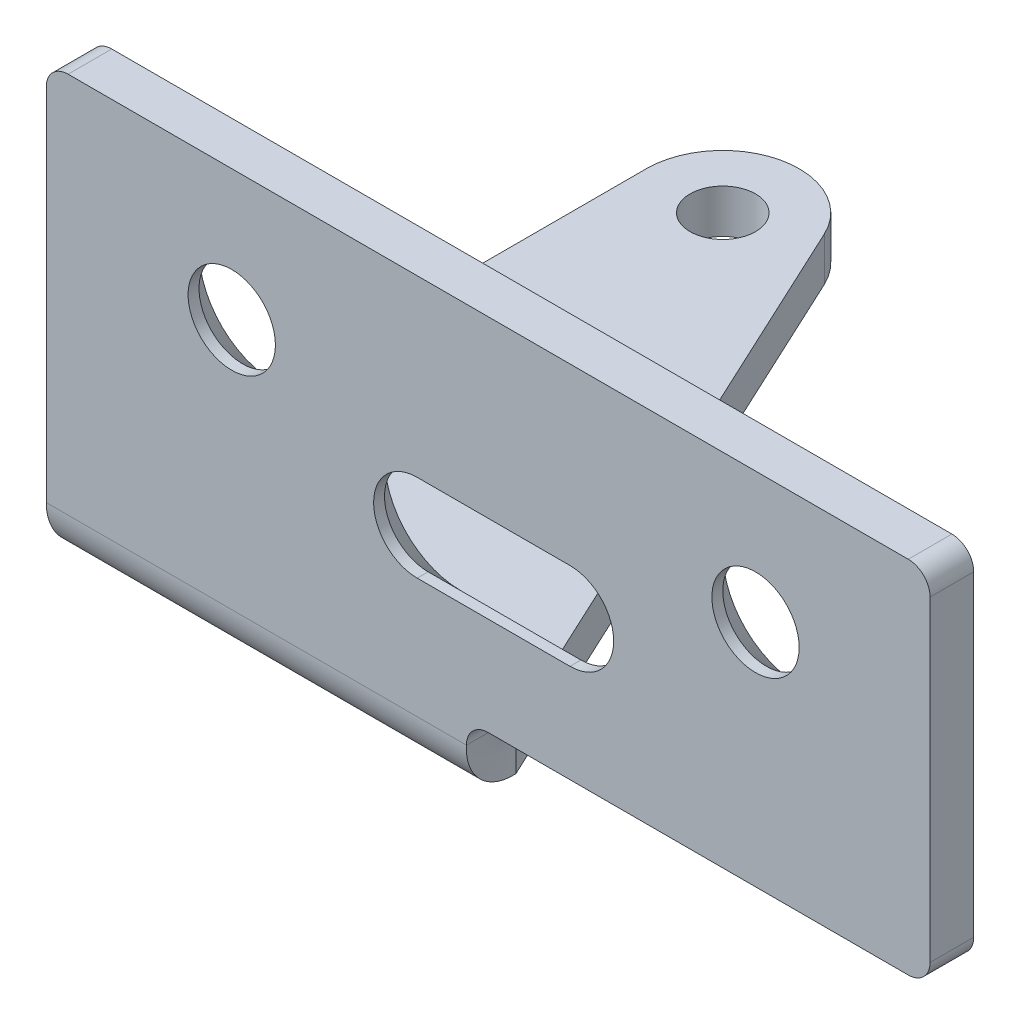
ISO-10303-21;
HEADER;
FILE_DESCRIPTION(('STEP AP214'),'2;1');
FILE_NAME('part.step','',(''),(''),'','','');
FILE_SCHEMA(('AUTOMOTIVE_DESIGN { 1 0 10303 214 1 1 1 1 }'));
ENDSEC;
DATA;
#1=APPLICATION_CONTEXT('core data for automotive mechanical design processes');
#2=APPLICATION_PROTOCOL_DEFINITION('international standard','automotive_design',2000,#1);
#3=PRODUCT_CONTEXT('',#1,'mechanical');
#4=PRODUCT('Part','Part','',(#3));
#5=PRODUCT_RELATED_PRODUCT_CATEGORY('part','',(#4));
#6=PRODUCT_DEFINITION_FORMATION('','',#4);
#7=PRODUCT_DEFINITION_CONTEXT('part definition',#1,'design');
#8=PRODUCT_DEFINITION('design','',#6,#7);
#9=PRODUCT_DEFINITION_SHAPE('','',#8);
#10=(LENGTH_UNIT() NAMED_UNIT(*) SI_UNIT(.MILLI.,.METRE.));
#11=(NAMED_UNIT(*) PLANE_ANGLE_UNIT() SI_UNIT($,.RADIAN.));
#12=(NAMED_UNIT(*) SI_UNIT($,.STERADIAN.) SOLID_ANGLE_UNIT());
#13=UNCERTAINTY_MEASURE_WITH_UNIT(LENGTH_MEASURE(1.E-05),#10,'distance_accuracy_value','');
#14=(GEOMETRIC_REPRESENTATION_CONTEXT(3) GLOBAL_UNCERTAINTY_ASSIGNED_CONTEXT((#13)) GLOBAL_UNIT_ASSIGNED_CONTEXT((#10,
#11,#12)) REPRESENTATION_CONTEXT('',''));
#15=CARTESIAN_POINT('',(0.,0.,0.));
#16=DIRECTION('',(0.,0.,1.));
#17=DIRECTION('',(1.,0.,0.));
#18=AXIS2_PLACEMENT_3D('',#15,#16,#17);
#19=CARTESIAN_POINT('',(0.,0.,-2.));
#20=DIRECTION('',(1.,0.,0.));
#21=DIRECTION('',(0.,1.,0.));
#22=AXIS2_PLACEMENT_3D('',#19,#20,#21);
#23=PLANE('',#22);
#24=DIRECTION('',(0.,-1.,0.));
#25=VECTOR('',#24,1.);
#26=CARTESIAN_POINT('',(0.,0.,-2.));
#27=LINE('',#26,#25);
#28=CARTESIAN_POINT('',(0.,19.,-2.));
#29=VERTEX_POINT('',#28);
#30=CARTESIAN_POINT('',(0.,2.5,-2.));
#31=VERTEX_POINT('',#30);
#32=EDGE_CURVE('E377',#29,#31,#27,.T.);
#33=ORIENTED_EDGE('',*,*,#32,.T.);
#34=DIRECTION('',(0.,0.,1.));
#35=VECTOR('',#34,1.);
#36=CARTESIAN_POINT('',(0.,2.5,-2.));
#37=LINE('',#36,#35);
#38=CARTESIAN_POINT('',(0.,2.50000000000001,0.));
#39=VERTEX_POINT('',#38);
#40=EDGE_CURVE('E368',#31,#39,#37,.T.);
#41=ORIENTED_EDGE('',*,*,#40,.T.);
#42=DIRECTION('',(0.,-1.,0.));
#43=VECTOR('',#42,1.);
#44=CARTESIAN_POINT('',(0.,0.,0.));
#45=LINE('',#44,#43);
#46=CARTESIAN_POINT('',(0.,19.,0.));
#47=VERTEX_POINT('',#46);
#48=EDGE_CURVE('E367',#47,#39,#45,.T.);
#49=ORIENTED_EDGE('',*,*,#48,.F.);
#50=DIRECTION('',(0.,0.,1.));
#51=VECTOR('',#50,1.);
#52=CARTESIAN_POINT('',(0.,19.,-2.));
#53=LINE('',#52,#51);
#54=EDGE_CURVE('E415',#29,#47,#53,.T.);
#55=ORIENTED_EDGE('',*,*,#54,.F.);
#56=EDGE_LOOP('',(#33,#41,#49,#55));
#57=FACE_BOUND('',#56,.T.);
#58=ADVANCED_FACE('F39',(#57),#23,.F.);
#59=CARTESIAN_POINT('',(0.,0.,-2.));
#60=DIRECTION('',(0.,0.,1.));
#61=DIRECTION('',(-1.,0.,0.));
#62=AXIS2_PLACEMENT_3D('',#59,#60,#61);
#63=PLANE('',#62);
#64=CARTESIAN_POINT('',(17.,10.,-2.));
#65=DIRECTION('',(0.,0.,1.));
#66=DIRECTION('',(1.,0.,0.));
#67=AXIS2_PLACEMENT_3D('',#64,#65,#66);
#68=CIRCLE('',#67,3.5);
#69=CARTESIAN_POINT('',(17.,13.5,-2.));
#70=VERTEX_POINT('',#69);
#71=CARTESIAN_POINT('',(17.,6.5,-2.));
#72=VERTEX_POINT('',#71);
#73=EDGE_CURVE('E190',#70,#72,#68,.T.);
#74=ORIENTED_EDGE('',*,*,#73,.T.);
#75=DIRECTION('',(1.,0.,0.));
#76=VECTOR('',#75,1.);
#77=CARTESIAN_POINT('',(17.,6.49999999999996,-2.));
#78=LINE('',#77,#76);
#79=CARTESIAN_POINT('',(24.,6.49999999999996,-2.));
#80=VERTEX_POINT('',#79);
#81=EDGE_CURVE('E753',#72,#80,#78,.T.);
#82=ORIENTED_EDGE('',*,*,#81,.T.);
#83=CARTESIAN_POINT('',(24.,10.,-2.));
#84=DIRECTION('',(0.,0.,1.));
#85=DIRECTION('',(1.,0.,0.));
#86=AXIS2_PLACEMENT_3D('',#83,#84,#85);
#87=CIRCLE('',#86,3.5);
#88=CARTESIAN_POINT('',(24.,13.5,-2.));
#89=VERTEX_POINT('',#88);
#90=EDGE_CURVE('E192',#80,#89,#87,.T.);
#91=ORIENTED_EDGE('',*,*,#90,.T.);
#92=DIRECTION('',(1.,0.,0.));
#93=VECTOR('',#92,1.);
#94=CARTESIAN_POINT('',(17.,13.5,-2.));
#95=LINE('',#94,#93);
#96=EDGE_CURVE('E175',#70,#89,#95,.T.);
#97=ORIENTED_EDGE('',*,*,#96,.F.);
#98=EDGE_LOOP('',(#74,#82,#91,#97));
#99=FACE_BOUND('',#98,.T.);
#100=CARTESIAN_POINT('',(8.49999999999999,14.,-2.));
#101=DIRECTION('',(0.,0.,1.));
#102=DIRECTION('',(1.,0.,0.));
#103=AXIS2_PLACEMENT_3D('',#100,#101,#102);
#104=CIRCLE('',#103,3.5);
#105=CARTESIAN_POINT('',(12.,14.,-2.));
#106=VERTEX_POINT('',#105);
#107=EDGE_CURVE('E225',#106,#106,#104,.T.);
#108=ORIENTED_EDGE('',*,*,#107,.T.);
#109=EDGE_LOOP('',(#108));
#110=FACE_BOUND('',#109,.T.);
#111=CARTESIAN_POINT('',(32.5,14.,-2.));
#112=DIRECTION('',(0.,0.,1.));
#113=DIRECTION('',(1.,0.,0.));
#114=AXIS2_PLACEMENT_3D('',#111,#112,#113);
#115=CIRCLE('',#114,3.5);
#116=CARTESIAN_POINT('',(36.,14.,-2.));
#117=VERTEX_POINT('',#116);
#118=EDGE_CURVE('E234',#117,#117,#115,.T.);
#119=ORIENTED_EDGE('',*,*,#118,.T.);
#120=EDGE_LOOP('',(#119));
#121=FACE_BOUND('',#120,.T.);
#122=DIRECTION('',(0.,1.,0.));
#123=VECTOR('',#122,1.);
#124=CARTESIAN_POINT('',(40.5,0.,-2.));
#125=LINE('',#124,#123);
#126=CARTESIAN_POINT('',(40.5,4.5,-2.));
#127=VERTEX_POINT('',#126);
#128=CARTESIAN_POINT('',(40.5,19.,-2.));
#129=VERTEX_POINT('',#128);
#130=EDGE_CURVE('E380',#127,#129,#125,.T.);
#131=ORIENTED_EDGE('',*,*,#130,.F.);
#132=CARTESIAN_POINT('',(39.5,4.5,-2.));
#133=DIRECTION('',(0.,0.,-1.));
#134=DIRECTION('',(-1.,0.,0.));
#135=AXIS2_PLACEMENT_3D('',#132,#133,#134);
#136=CIRCLE('',#135,1.);
#137=CARTESIAN_POINT('',(39.5,3.5,-2.));
#138=VERTEX_POINT('',#137);
#139=EDGE_CURVE('E366',#138,#127,#136,.F.);
#140=ORIENTED_EDGE('',*,*,#139,.F.);
#141=DIRECTION('',(-1.,0.,0.));
#142=VECTOR('',#141,1.);
#143=CARTESIAN_POINT('',(20.2526679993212,3.5,-2.));
#144=LINE('',#143,#142);
#145=CARTESIAN_POINT('',(20.2526679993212,3.5,-2.));
#146=VERTEX_POINT('',#145);
#147=EDGE_CURVE('E363',#138,#146,#144,.T.);
#148=ORIENTED_EDGE('',*,*,#147,.T.);
#149=CARTESIAN_POINT('',(20.2526679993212,2.5,-2.));
#150=DIRECTION('',(0.,0.,-1.));
#151=DIRECTION('',(-1.,0.,0.));
#152=AXIS2_PLACEMENT_3D('',#149,#150,#151);
#153=CIRCLE('',#152,1.);
#154=CARTESIAN_POINT('',(19.2526679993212,2.5,-2.));
#155=VERTEX_POINT('',#154);
#156=EDGE_CURVE('E11',#155,#146,#153,.T.);
#157=ORIENTED_EDGE('',*,*,#156,.F.);
#158=DIRECTION('',(1.,0.,0.));
#159=VECTOR('',#158,1.);
#160=CARTESIAN_POINT('',(19.2526679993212,2.5,-2.));
#161=LINE('',#160,#159);
#162=EDGE_CURVE('E285',#155,#31,#161,.F.);
#163=ORIENTED_EDGE('',*,*,#162,.T.);
#164=ORIENTED_EDGE('',*,*,#32,.F.);
#165=CARTESIAN_POINT('',(0.999999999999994,19.,-2.));
#166=DIRECTION('',(0.,0.,-1.));
#167=DIRECTION('',(-1.,0.,0.));
#168=AXIS2_PLACEMENT_3D('',#165,#166,#167);
#169=CIRCLE('',#168,1.);
#170=CARTESIAN_POINT('',(0.999999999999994,20.,-2.));
#171=VERTEX_POINT('',#170);
#172=EDGE_CURVE('E54',#171,#29,#169,.F.);
#173=ORIENTED_EDGE('',*,*,#172,.F.);
#174=DIRECTION('',(-1.,0.,0.));
#175=VECTOR('',#174,1.);
#176=CARTESIAN_POINT('',(0.,20.,-2.));
#177=LINE('',#176,#175);
#178=CARTESIAN_POINT('',(39.5,20.,-2.));
#179=VERTEX_POINT('',#178);
#180=EDGE_CURVE('E384',#179,#171,#177,.T.);
#181=ORIENTED_EDGE('',*,*,#180,.F.);
#182=CARTESIAN_POINT('',(39.5,19.,-2.));
#183=DIRECTION('',(0.,0.,-1.));
#184=DIRECTION('',(-1.,0.,0.));
#185=AXIS2_PLACEMENT_3D('',#182,#183,#184);
#186=CIRCLE('',#185,1.);
#187=EDGE_CURVE('E412',#129,#179,#186,.F.);
#188=ORIENTED_EDGE('',*,*,#187,.F.);
#189=EDGE_LOOP('',(#131,#140,#148,#157,#163,#164,#173,#181,#188));
#190=FACE_BOUND('',#189,.T.);
#191=ADVANCED_FACE('F187',(#99,#110,#121,#190),#63,.F.);
#192=CARTESIAN_POINT('',(0.,0.,0.));
#193=DIRECTION('',(0.,0.,1.));
#194=DIRECTION('',(-1.,0.,0.));
#195=AXIS2_PLACEMENT_3D('',#192,#193,#194);
#196=PLANE('',#195);
#197=CARTESIAN_POINT('',(17.,10.,0.));
#198=DIRECTION('',(0.,0.,1.));
#199=DIRECTION('',(1.,0.,0.));
#200=AXIS2_PLACEMENT_3D('',#197,#198,#199);
#201=CIRCLE('',#200,2.);
#202=CARTESIAN_POINT('',(17.,12.,0.));
#203=VERTEX_POINT('',#202);
#204=CARTESIAN_POINT('',(17.,8.,0.));
#205=VERTEX_POINT('',#204);
#206=EDGE_CURVE('E201',#203,#205,#201,.T.);
#207=ORIENTED_EDGE('',*,*,#206,.F.);
#208=DIRECTION('',(1.,0.,0.));
#209=VECTOR('',#208,1.);
#210=CARTESIAN_POINT('',(17.,12.,0.));
#211=LINE('',#210,#209);
#212=CARTESIAN_POINT('',(24.,12.,0.));
#213=VERTEX_POINT('',#212);
#214=EDGE_CURVE('E762',#203,#213,#211,.T.);
#215=ORIENTED_EDGE('',*,*,#214,.T.);
#216=CARTESIAN_POINT('',(24.,10.,0.));
#217=DIRECTION('',(0.,0.,1.));
#218=DIRECTION('',(1.,0.,0.));
#219=AXIS2_PLACEMENT_3D('',#216,#217,#218);
#220=CIRCLE('',#219,2.);
#221=CARTESIAN_POINT('',(24.,8.,0.));
#222=VERTEX_POINT('',#221);
#223=EDGE_CURVE('E217',#222,#213,#220,.T.);
#224=ORIENTED_EDGE('',*,*,#223,.F.);
#225=DIRECTION('',(1.,0.,0.));
#226=VECTOR('',#225,1.);
#227=CARTESIAN_POINT('',(17.,8.,0.));
#228=LINE('',#227,#226);
#229=EDGE_CURVE('E759',#205,#222,#228,.T.);
#230=ORIENTED_EDGE('',*,*,#229,.F.);
#231=EDGE_LOOP('',(#207,#215,#224,#230));
#232=FACE_BOUND('',#231,.T.);
#233=CARTESIAN_POINT('',(8.49999999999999,14.,0.));
#234=DIRECTION('',(0.,0.,1.));
#235=DIRECTION('',(1.,0.,0.));
#236=AXIS2_PLACEMENT_3D('',#233,#234,#235);
#237=CIRCLE('',#236,2.);
#238=CARTESIAN_POINT('',(10.5,14.,0.));
#239=VERTEX_POINT('',#238);
#240=EDGE_CURVE('E231',#239,#239,#237,.T.);
#241=ORIENTED_EDGE('',*,*,#240,.F.);
#242=EDGE_LOOP('',(#241));
#243=FACE_BOUND('',#242,.T.);
#244=CARTESIAN_POINT('',(32.5,14.,0.));
#245=DIRECTION('',(0.,0.,1.));
#246=DIRECTION('',(1.,0.,0.));
#247=AXIS2_PLACEMENT_3D('',#244,#245,#246);
#248=CIRCLE('',#247,2.);
#249=CARTESIAN_POINT('',(34.5,14.,0.));
#250=VERTEX_POINT('',#249);
#251=EDGE_CURVE('E240',#250,#250,#248,.T.);
#252=ORIENTED_EDGE('',*,*,#251,.F.);
#253=EDGE_LOOP('',(#252));
#254=FACE_BOUND('',#253,.T.);
#255=DIRECTION('',(-1.,0.,0.));
#256=VECTOR('',#255,1.);
#257=CARTESIAN_POINT('',(0.,20.,0.));
#258=LINE('',#257,#256);
#259=CARTESIAN_POINT('',(39.5,20.,0.));
#260=VERTEX_POINT('',#259);
#261=CARTESIAN_POINT('',(0.999999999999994,20.,0.));
#262=VERTEX_POINT('',#261);
#263=EDGE_CURVE('E381',#260,#262,#258,.T.);
#264=ORIENTED_EDGE('',*,*,#263,.T.);
#265=CARTESIAN_POINT('',(0.999999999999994,19.,0.));
#266=DIRECTION('',(0.,0.,-1.));
#267=DIRECTION('',(-1.,0.,0.));
#268=AXIS2_PLACEMENT_3D('',#265,#266,#267);
#269=CIRCLE('',#268,1.);
#270=EDGE_CURVE('E400',#47,#262,#269,.T.);
#271=ORIENTED_EDGE('',*,*,#270,.F.);
#272=ORIENTED_EDGE('',*,*,#48,.T.);
#273=DIRECTION('',(1.,0.,0.));
#274=VECTOR('',#273,1.);
#275=CARTESIAN_POINT('',(19.2526679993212,2.5,0.));
#276=LINE('',#275,#274);
#277=CARTESIAN_POINT('',(19.2526679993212,2.5,0.));
#278=VERTEX_POINT('',#277);
#279=EDGE_CURVE('E280',#278,#39,#276,.F.);
#280=ORIENTED_EDGE('',*,*,#279,.F.);
#281=CARTESIAN_POINT('',(20.2526679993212,2.50000000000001,0.));
#282=DIRECTION('',(0.,0.,-1.));
#283=DIRECTION('',(-1.,0.,0.));
#284=AXIS2_PLACEMENT_3D('',#281,#282,#283);
#285=CIRCLE('',#284,1.);
#286=CARTESIAN_POINT('',(20.2526679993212,3.50000000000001,0.));
#287=VERTEX_POINT('',#286);
#288=EDGE_CURVE('E47',#287,#278,#285,.F.);
#289=ORIENTED_EDGE('',*,*,#288,.F.);
#290=DIRECTION('',(-1.,0.,0.));
#291=VECTOR('',#290,1.);
#292=CARTESIAN_POINT('',(0.,3.50000000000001,0.));
#293=LINE('',#292,#291);
#294=CARTESIAN_POINT('',(39.5,3.50000000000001,0.));
#295=VERTEX_POINT('',#294);
#296=EDGE_CURVE('E386',#295,#287,#293,.T.);
#297=ORIENTED_EDGE('',*,*,#296,.F.);
#298=CARTESIAN_POINT('',(39.5,4.50000000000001,0.));
#299=DIRECTION('',(0.,0.,-1.));
#300=DIRECTION('',(-1.,0.,0.));
#301=AXIS2_PLACEMENT_3D('',#298,#299,#300);
#302=CIRCLE('',#301,1.);
#303=CARTESIAN_POINT('',(40.5,4.50000000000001,0.));
#304=VERTEX_POINT('',#303);
#305=EDGE_CURVE('E397',#304,#295,#302,.T.);
#306=ORIENTED_EDGE('',*,*,#305,.F.);
#307=DIRECTION('',(0.,1.,0.));
#308=VECTOR('',#307,1.);
#309=CARTESIAN_POINT('',(40.5,0.,0.));
#310=LINE('',#309,#308);
#311=CARTESIAN_POINT('',(40.5,19.,0.));
#312=VERTEX_POINT('',#311);
#313=EDGE_CURVE('E371',#304,#312,#310,.T.);
#314=ORIENTED_EDGE('',*,*,#313,.T.);
#315=CARTESIAN_POINT('',(39.5,19.,0.));
#316=DIRECTION('',(0.,0.,-1.));
#317=DIRECTION('',(-1.,0.,0.));
#318=AXIS2_PLACEMENT_3D('',#315,#316,#317);
#319=CIRCLE('',#318,1.);
#320=EDGE_CURVE('E403',#260,#312,#319,.T.);
#321=ORIENTED_EDGE('',*,*,#320,.F.);
#322=EDGE_LOOP('',(#264,#271,#272,#280,#289,#297,#306,#314,#321));
#323=FACE_BOUND('',#322,.T.);
#324=ADVANCED_FACE('F328',(#232,#243,#254,#323),#196,.T.);
#325=CARTESIAN_POINT('',(40.5,0.,-2.));
#326=DIRECTION('',(-1.,0.,0.));
#327=DIRECTION('',(0.,0.,-1.));
#328=AXIS2_PLACEMENT_3D('',#325,#326,#327);
#329=PLANE('',#328);
#330=ORIENTED_EDGE('',*,*,#313,.F.);
#331=DIRECTION('',(0.,0.,-1.));
#332=VECTOR('',#331,1.);
#333=CARTESIAN_POINT('',(40.5,4.50000000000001,0.));
#334=LINE('',#333,#332);
#335=EDGE_CURVE('E406',#127,#304,#334,.F.);
#336=ORIENTED_EDGE('',*,*,#335,.F.);
#337=ORIENTED_EDGE('',*,*,#130,.T.);
#338=DIRECTION('',(0.,0.,1.));
#339=VECTOR('',#338,1.);
#340=CARTESIAN_POINT('',(40.5,19.,-2.));
#341=LINE('',#340,#339);
#342=EDGE_CURVE('E408',#312,#129,#341,.F.);
#343=ORIENTED_EDGE('',*,*,#342,.F.);
#344=EDGE_LOOP('',(#330,#336,#337,#343));
#345=FACE_BOUND('',#344,.T.);
#346=ADVANCED_FACE('F331',(#345),#329,.F.);
#347=CARTESIAN_POINT('',(0.,20.,-2.));
#348=DIRECTION('',(0.,-1.,0.));
#349=DIRECTION('',(0.,0.,1.));
#350=AXIS2_PLACEMENT_3D('',#347,#348,#349);
#351=PLANE('',#350);
#352=ORIENTED_EDGE('',*,*,#180,.T.);
#353=DIRECTION('',(0.,0.,1.));
#354=VECTOR('',#353,1.);
#355=CARTESIAN_POINT('',(0.999999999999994,20.,-2.));
#356=LINE('',#355,#354);
#357=EDGE_CURVE('E393',#262,#171,#356,.F.);
#358=ORIENTED_EDGE('',*,*,#357,.F.);
#359=ORIENTED_EDGE('',*,*,#263,.F.);
#360=DIRECTION('',(0.,0.,1.));
#361=VECTOR('',#360,1.);
#362=CARTESIAN_POINT('',(39.5,20.,-2.));
#363=LINE('',#362,#361);
#364=EDGE_CURVE('E395',#179,#260,#363,.T.);
#365=ORIENTED_EDGE('',*,*,#364,.F.);
#366=EDGE_LOOP('',(#352,#358,#359,#365));
#367=FACE_BOUND('',#366,.T.);
#368=ADVANCED_FACE('F325',(#367),#351,.F.);
#369=CARTESIAN_POINT('',(20.2526679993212,3.5,-2.));
#370=DIRECTION('',(0.,-1.,0.));
#371=DIRECTION('',(0.,0.,1.));
#372=AXIS2_PLACEMENT_3D('',#369,#370,#371);
#373=PLANE('',#372);
#374=ORIENTED_EDGE('',*,*,#147,.F.);
#375=DIRECTION('',(0.,0.,-1.));
#376=VECTOR('',#375,1.);
#377=CARTESIAN_POINT('',(39.5,3.5,-2.));
#378=LINE('',#377,#376);
#379=EDGE_CURVE('E417',#295,#138,#378,.T.);
#380=ORIENTED_EDGE('',*,*,#379,.F.);
#381=ORIENTED_EDGE('',*,*,#296,.T.);
#382=DIRECTION('',(0.,0.,1.));
#383=VECTOR('',#382,1.);
#384=CARTESIAN_POINT('',(20.2526679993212,3.50000000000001,0.));
#385=LINE('',#384,#383);
#386=EDGE_CURVE('E62',#146,#287,#385,.T.);
#387=ORIENTED_EDGE('',*,*,#386,.F.);
#388=EDGE_LOOP('',(#374,#380,#381,#387));
#389=FACE_BOUND('',#388,.T.);
#390=ADVANCED_FACE('F311',(#389),#373,.T.);
#391=CARTESIAN_POINT('',(0.,2.5,-2.5));
#392=DIRECTION('',(-1.,0.,0.));
#393=DIRECTION('',(0.,0.,-1.));
#394=AXIS2_PLACEMENT_3D('',#391,#392,#393);
#395=PLANE('',#394);
#396=DIRECTION('',(0.,1.,0.));
#397=VECTOR('',#396,1.);
#398=CARTESIAN_POINT('',(0.,0.,-2.49999999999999));
#399=LINE('',#398,#397);
#400=CARTESIAN_POINT('',(0.,2.,-2.5));
#401=VERTEX_POINT('',#400);
#402=CARTESIAN_POINT('',(0.,0.,-2.49999999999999));
#403=VERTEX_POINT('',#402);
#404=EDGE_CURVE('E243',#401,#403,#399,.F.);
#405=ORIENTED_EDGE('',*,*,#404,.T.);
#406=CARTESIAN_POINT('',(0.,2.5,-2.5));
#407=DIRECTION('',(-1.,0.,0.));
#408=DIRECTION('',(0.,0.,1.));
#409=AXIS2_PLACEMENT_3D('',#406,#407,#408);
#410=CIRCLE('',#409,2.5);
#411=EDGE_CURVE('E276',#39,#403,#410,.F.);
#412=ORIENTED_EDGE('',*,*,#411,.F.);
#413=ORIENTED_EDGE('',*,*,#40,.F.);
#414=CARTESIAN_POINT('',(0.,2.5,-2.5));
#415=DIRECTION('',(-1.,0.,0.));
#416=DIRECTION('',(0.,0.,1.));
#417=AXIS2_PLACEMENT_3D('',#414,#415,#416);
#418=CIRCLE('',#417,0.5);
#419=EDGE_CURVE('E281',#31,#401,#418,.F.);
#420=ORIENTED_EDGE('',*,*,#419,.T.);
#421=EDGE_LOOP('',(#405,#412,#413,#420));
#422=FACE_BOUND('',#421,.T.);
#423=ADVANCED_FACE('F307',(#422),#395,.T.);
#424=CARTESIAN_POINT('',(19.0195141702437,-0.0200000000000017,-2.5));
#425=CARTESIAN_POINT('',(19.0389471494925,-0.0200000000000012,-2.17007349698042));
#426=CARTESIAN_POINT('',(19.0583731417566,0.0455888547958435,-1.84039533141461));
#427=CARTESIAN_POINT('',(19.0972321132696,0.298058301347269,-1.23088016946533));
#428=CARTESIAN_POINT('',(19.116661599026,0.484839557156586,-0.951342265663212));
#429=CARTESIAN_POINT('',(19.1555205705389,0.951342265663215,-0.484839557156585));
#430=CARTESIAN_POINT('',(19.1749500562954,1.23088016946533,-0.29805830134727));
#431=CARTESIAN_POINT('',(19.2138090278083,1.84039533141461,-0.0455888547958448));
#432=CARTESIAN_POINT('',(19.2332350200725,2.17007349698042,0.0199999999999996));
#433=CARTESIAN_POINT('',(19.2526679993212,2.5,0.0199999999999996));
#434=CARTESIAN_POINT('',(19.0195141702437,0.,-2.5));
#435=CARTESIAN_POINT('',(19.0389471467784,0.,-2.17269197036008));
#436=CARTESIAN_POINT('',(19.0583731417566,0.0650683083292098,-1.8456302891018));
#437=CARTESIAN_POINT('',(19.0972321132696,0.315534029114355,-1.24095254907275));
#438=CARTESIAN_POINT('',(19.116661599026,0.50083289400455,-0.96363320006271));
#439=CARTESIAN_POINT('',(19.1555205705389,0.963633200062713,-0.500832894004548));
#440=CARTESIAN_POINT('',(19.1749500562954,1.24095254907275,-0.315534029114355));
#441=CARTESIAN_POINT('',(19.2138090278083,1.8456302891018,-0.0650683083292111));
#442=CARTESIAN_POINT('',(19.2332350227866,2.17269197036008,0.));
#443=CARTESIAN_POINT('',(19.2526679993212,2.5,0.));
#444=CARTESIAN_POINT('',(19.0195141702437,2.,-2.5));
#445=CARTESIAN_POINT('',(19.0389468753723,2.,-2.43453930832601));
#446=CARTESIAN_POINT('',(19.0583731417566,2.01301366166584,-2.36912605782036));
#447=CARTESIAN_POINT('',(19.0972321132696,2.06310680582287,-2.24819050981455));
#448=CARTESIAN_POINT('',(19.116661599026,2.10016657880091,-2.19272664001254));
#449=CARTESIAN_POINT('',(19.1555205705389,2.19272664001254,-2.10016657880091));
#450=CARTESIAN_POINT('',(19.1749500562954,2.24819050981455,-2.06310680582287));
#451=CARTESIAN_POINT('',(19.2138090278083,2.36912605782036,-2.01301366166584));
#452=CARTESIAN_POINT('',(19.2332352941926,2.43453930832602,-2.));
#453=CARTESIAN_POINT('',(19.2526679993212,2.5,-2.));
#454=CARTESIAN_POINT('',(19.0195141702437,2.0202,-2.5));
#455=CARTESIAN_POINT('',(19.0389468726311,2.0202,-2.43718396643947));
#456=CARTESIAN_POINT('',(19.0583731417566,2.03268790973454,-2.37441336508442));
#457=CARTESIAN_POINT('',(19.0972321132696,2.08075729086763,-2.25836361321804));
#458=CARTESIAN_POINT('',(19.116661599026,2.11631984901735,-2.20514048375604));
#459=CARTESIAN_POINT('',(19.1555205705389,2.20514048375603,-2.11631984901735));
#460=CARTESIAN_POINT('',(19.1749500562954,2.25836361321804,-2.08075729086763));
#461=CARTESIAN_POINT('',(19.2138090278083,2.37441336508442,-2.03268790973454));
#462=CARTESIAN_POINT('',(19.2332352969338,2.43718396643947,-2.0202));
#463=CARTESIAN_POINT('',(19.2526679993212,2.5,-2.0202));
#464=B_SPLINE_SURFACE_WITH_KNOTS('',1,3,((#424,#425,#426,#427,#428,#429,#430,#431,#432,#433),
(#434,#435,#436,#437,#438,#439,#440,#441,#442,#443),(#444,#445,#446,#447,#448,#449,#450,#451,
#452,#453),(#454,#455,#456,#457,#458,#459,#460,#461,#462,#463)),.UNSPECIFIED.,.F.,.F.,.F.,(2,1,
1,2),(4,2,2,2,4),(-0.01,0.,1.,1.0101),(0.,0.25,0.5,0.75,1.),.UNSPECIFIED.);
#465=CARTESIAN_POINT('',(19.0195141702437,2.,-2.5));
#466=CARTESIAN_POINT('',(19.0219428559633,1.99999982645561,-2.49181876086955));
#467=CARTESIAN_POINT('',(19.0243715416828,2.00020079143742,-2.48363753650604));
#468=CARTESIAN_POINT('',(19.029228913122,2.0010037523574,-2.46729478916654));
#469=CARTESIAN_POINT('',(19.0316575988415,2.00160574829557,-2.45913326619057));
#470=CARTESIAN_POINT('',(19.0365149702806,2.00320952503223,-2.44284959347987));
#471=CARTESIAN_POINT('',(19.0389436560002,2.00421130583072,-2.43472744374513));
#472=CARTESIAN_POINT('',(19.0438010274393,2.0066121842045,-2.41854208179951));
#473=CARTESIAN_POINT('',(19.0462297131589,2.0080112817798,-2.41047886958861));
#474=CARTESIAN_POINT('',(19.051087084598,2.01120343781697,-2.39443080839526));
#475=CARTESIAN_POINT('',(19.0535157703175,2.01299649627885,-2.3864459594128));
#476=CARTESIAN_POINT('',(19.0583731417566,2.0169722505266,-2.37057386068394));
#477=CARTESIAN_POINT('',(19.0608018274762,2.01915494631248,-2.36268661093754));
#478=CARTESIAN_POINT('',(19.0656591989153,2.02390471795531,-2.347028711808));
#479=CARTESIAN_POINT('',(19.0680878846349,2.02647179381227,-2.33925806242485));
#480=CARTESIAN_POINT('',(19.072945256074,2.0319841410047,-2.32385208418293));
#481=CARTESIAN_POINT('',(19.0753739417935,2.03492941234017,-2.31621675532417));
#482=CARTESIAN_POINT('',(19.0802313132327,2.04119105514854,-2.30109981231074));
#483=CARTESIAN_POINT('',(19.0826599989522,2.04450742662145,-2.29361819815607));
#484=CARTESIAN_POINT('',(19.0875173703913,2.0515032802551,-2.27882670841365));
#485=CARTESIAN_POINT('',(19.0899460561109,2.05518276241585,-2.27151683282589));
#486=CARTESIAN_POINT('',(19.09480342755,2.06289597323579,-2.25708643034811));
#487=CARTESIAN_POINT('',(19.0972321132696,2.06692970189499,-2.24996590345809));
#488=CARTESIAN_POINT('',(19.1020894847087,2.07534168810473,-2.23593135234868));
#489=CARTESIAN_POINT('',(19.1045181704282,2.07971994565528,-2.22901732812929));
#490=CARTESIAN_POINT('',(19.1093755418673,2.08881044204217,-2.2154124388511));
#491=CARTESIAN_POINT('',(19.1118042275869,2.09352268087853,-2.2087215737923));
#492=CARTESIAN_POINT('',(19.116661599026,2.10326978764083,-2.19557912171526));
#493=CARTESIAN_POINT('',(19.1190902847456,2.10830465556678,-2.18912753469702));
#494=CARTESIAN_POINT('',(19.1239476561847,2.11868489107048,-2.17647918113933));
#495=CARTESIAN_POINT('',(19.1263763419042,2.12403025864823,-2.17028241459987));
#496=CARTESIAN_POINT('',(19.1312337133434,2.13501861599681,-2.15815863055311));
#497=CARTESIAN_POINT('',(19.1336623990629,2.14066160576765,-2.1522316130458));
#498=CARTESIAN_POINT('',(19.138519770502,2.1522316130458,-2.14066160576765));
#499=CARTESIAN_POINT('',(19.1409484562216,2.15815863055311,-2.13501861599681));
#500=CARTESIAN_POINT('',(19.1458058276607,2.17028241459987,-2.12403025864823));
#501=CARTESIAN_POINT('',(19.1482345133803,2.17647918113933,-2.11868489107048));
#502=CARTESIAN_POINT('',(19.1530918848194,2.18912753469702,-2.10830465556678));
#503=CARTESIAN_POINT('',(19.1555205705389,2.19557912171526,-2.10326978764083));
#504=CARTESIAN_POINT('',(19.1603779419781,2.2087215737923,-2.09352268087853));
#505=CARTESIAN_POINT('',(19.1628066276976,2.2154124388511,-2.08881044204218));
#506=CARTESIAN_POINT('',(19.1676639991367,2.22901732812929,-2.07971994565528));
#507=CARTESIAN_POINT('',(19.1700926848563,2.23593135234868,-2.07534168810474));
#508=CARTESIAN_POINT('',(19.1749500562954,2.24996590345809,-2.06692970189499));
#509=CARTESIAN_POINT('',(19.177378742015,2.25708643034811,-2.06289597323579));
#510=CARTESIAN_POINT('',(19.1822361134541,2.27151683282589,-2.05518276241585));
#511=CARTESIAN_POINT('',(19.1846647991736,2.27882670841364,-2.05150328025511));
#512=CARTESIAN_POINT('',(19.1895221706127,2.29361819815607,-2.04450742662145));
#513=CARTESIAN_POINT('',(19.1919508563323,2.30109981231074,-2.04119105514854));
#514=CARTESIAN_POINT('',(19.1968082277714,2.31621675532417,-2.03492941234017));
#515=CARTESIAN_POINT('',(19.199236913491,2.32385208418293,-2.0319841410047));
#516=CARTESIAN_POINT('',(19.2040942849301,2.33925806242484,-2.02647179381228));
#517=CARTESIAN_POINT('',(19.2065229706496,2.34702871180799,-2.02390471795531));
#518=CARTESIAN_POINT('',(19.2113803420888,2.36268661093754,-2.01915494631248));
#519=CARTESIAN_POINT('',(19.2138090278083,2.37057386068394,-2.0169722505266));
#520=CARTESIAN_POINT('',(19.2186663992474,2.3864459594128,-2.01299649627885));
#521=CARTESIAN_POINT('',(19.221095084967,2.39443080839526,-2.01120343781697));
#522=CARTESIAN_POINT('',(19.2259524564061,2.41047886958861,-2.0080112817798));
#523=CARTESIAN_POINT('',(19.2283811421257,2.4185420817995,-2.0066121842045));
#524=CARTESIAN_POINT('',(19.2332385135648,2.43472744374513,-2.00421130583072));
#525=CARTESIAN_POINT('',(19.2356671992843,2.44284959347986,-2.00320952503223));
#526=CARTESIAN_POINT('',(19.2405245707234,2.45913326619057,-2.00160574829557));
#527=CARTESIAN_POINT('',(19.242953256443,2.46729478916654,-2.0010037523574));
#528=CARTESIAN_POINT('',(19.2478106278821,2.48363753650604,-2.00020079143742));
#529=CARTESIAN_POINT('',(19.2502393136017,2.49181876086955,-1.99999982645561));
#530=CARTESIAN_POINT('',(19.2526679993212,2.5,-2.));
#531=B_SPLINE_CURVE_WITH_KNOTS('',3,(#465,#466,#467,#468,#469,#470,#471,#472,#473,#474,#475,
#476,#477,#478,#479,#480,#481,#482,#483,#484,#485,#486,#487,#488,#489,#490,#491,#492,#493,#494,
#495,#496,#497,#498,#499,#500,#501,#502,#503,#504,#505,#506,#507,#508,#509,#510,#511,#512,#513,
#514,#515,#516,#517,#518,#519,#520,#521,#522,#523,#524,#525,#526,#527,#528,#529,#530),
.UNSPECIFIED.,.F.,.F.,(4,2,2,2,2,2,2,2,2,2,2,2,2,2,2,2,2,2,2,2,2,2,2,2,2,2,2,2,2,2,2,2,4),(0.,
0.0255999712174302,0.0511999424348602,0.0767999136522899,0.102399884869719,0.127999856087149,
0.153599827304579,0.179199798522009,0.204799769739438,0.230399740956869,0.255999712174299,
0.281599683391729,0.307199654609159,0.332799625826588,0.358399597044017,0.383999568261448,
0.409599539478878,0.435199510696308,0.460799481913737,0.486399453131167,0.511999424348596,
0.537599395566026,0.563199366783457,0.588799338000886,0.614399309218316,0.639999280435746,
0.665599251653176,0.691199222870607,0.716799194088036,0.742399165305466,0.767999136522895,
0.793599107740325,0.819199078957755),.UNSPECIFIED.);
#532=CARTESIAN_POINT('',(19.0195141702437,2.,-2.5));
#533=VERTEX_POINT('',#532);
#534=EDGE_CURVE('E251',#533,#155,#531,.T.);
#535=DIRECTION('',(0.,0.,1.));
#536=VECTOR('',#535,1.);
#537=CARTESIAN_POINT('',(19.2526679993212,2.5,-2.));
#538=LINE('',#537,#536);
#539=EDGE_CURVE('E279',#155,#278,#538,.T.);
#540=CARTESIAN_POINT('',(19.0195141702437,0.,-2.5));
#541=CARTESIAN_POINT('',(19.0219428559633,-8.67721939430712E-07,-2.45909380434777));
#542=CARTESIAN_POINT('',(19.0243715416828,0.00100395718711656,-2.41818768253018));
#543=CARTESIAN_POINT('',(19.029228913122,0.00501876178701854,-2.33647394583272));
#544=CARTESIAN_POINT('',(19.0316575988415,0.00802874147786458,-2.29566633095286));
#545=CARTESIAN_POINT('',(19.0365149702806,0.0160476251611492,-2.21424796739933));
#546=CARTESIAN_POINT('',(19.0389436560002,0.0210565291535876,-2.17363721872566));
#547=CARTESIAN_POINT('',(19.0438010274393,0.0330609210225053,-2.09271040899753));
#548=CARTESIAN_POINT('',(19.0462297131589,0.0400564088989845,-2.05239434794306));
#549=CARTESIAN_POINT('',(19.051087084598,0.0560171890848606,-1.97215404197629));
#550=CARTESIAN_POINT('',(19.0535157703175,0.0649824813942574,-1.93222979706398));
#551=CARTESIAN_POINT('',(19.0583731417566,0.0848612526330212,-1.85286930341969));
#552=CARTESIAN_POINT('',(19.0608018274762,0.0957747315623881,-1.81343305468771));
#553=CARTESIAN_POINT('',(19.0656591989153,0.119523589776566,-1.73514355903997));
#554=CARTESIAN_POINT('',(19.0680878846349,0.132358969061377,-1.69629031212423));
#555=CARTESIAN_POINT('',(19.072945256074,0.159920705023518,-1.61926042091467));
#556=CARTESIAN_POINT('',(19.0753739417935,0.174647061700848,-1.58108377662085));
#557=CARTESIAN_POINT('',(19.0802313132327,0.205955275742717,-1.5054990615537));
#558=CARTESIAN_POINT('',(19.0826599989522,0.222537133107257,-1.46809099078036));
#559=CARTESIAN_POINT('',(19.0875173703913,0.257516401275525,-1.39413354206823));
#560=CARTESIAN_POINT('',(19.0899460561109,0.275913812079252,-1.35758416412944));
#561=CARTESIAN_POINT('',(19.09480342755,0.314479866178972,-1.28543215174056));
#562=CARTESIAN_POINT('',(19.0972321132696,0.334648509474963,-1.24982951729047));
#563=CARTESIAN_POINT('',(19.1020894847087,0.376708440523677,-1.17965676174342));
#564=CARTESIAN_POINT('',(19.1045181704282,0.398599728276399,-1.14508664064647));
#565=CARTESIAN_POINT('',(19.1093755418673,0.444052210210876,-1.07706219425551));
#566=CARTESIAN_POINT('',(19.1118042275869,0.46761340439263,-1.04360786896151));
#567=CARTESIAN_POINT('',(19.116661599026,0.516348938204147,-0.977895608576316));
#568=CARTESIAN_POINT('',(19.1190902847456,0.54152327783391,-0.945637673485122));
#569=CARTESIAN_POINT('',(19.1239476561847,0.593424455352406,-0.882395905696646));
#570=CARTESIAN_POINT('',(19.1263763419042,0.620151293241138,-0.851412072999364));
#571=CARTESIAN_POINT('',(19.1312337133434,0.675093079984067,-0.790793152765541));
#572=CARTESIAN_POINT('',(19.1336623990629,0.703308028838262,-0.761158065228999));
#573=CARTESIAN_POINT('',(19.138519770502,0.761158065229,-0.703308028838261));
#574=CARTESIAN_POINT('',(19.1409484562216,0.790793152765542,-0.675093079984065));
#575=CARTESIAN_POINT('',(19.1458058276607,0.851412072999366,-0.620151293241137));
#576=CARTESIAN_POINT('',(19.1482345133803,0.882395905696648,-0.593424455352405));
#577=CARTESIAN_POINT('',(19.1530918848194,0.945637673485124,-0.541523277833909));
#578=CARTESIAN_POINT('',(19.1555205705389,0.977895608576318,-0.516348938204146));
#579=CARTESIAN_POINT('',(19.1603779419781,1.04360786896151,-0.467613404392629));
#580=CARTESIAN_POINT('',(19.1628066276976,1.07706219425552,-0.444052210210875));
#581=CARTESIAN_POINT('',(19.1676639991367,1.14508664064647,-0.398599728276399));
#582=CARTESIAN_POINT('',(19.1700926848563,1.17965676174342,-0.376708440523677));
#583=CARTESIAN_POINT('',(19.1749500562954,1.24982951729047,-0.334648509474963));
#584=CARTESIAN_POINT('',(19.177378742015,1.28543215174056,-0.314479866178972));
#585=CARTESIAN_POINT('',(19.1822361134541,1.35758416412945,-0.275913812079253));
#586=CARTESIAN_POINT('',(19.1846647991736,1.39413354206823,-0.257516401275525));
#587=CARTESIAN_POINT('',(19.1895221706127,1.46809099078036,-0.222537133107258));
#588=CARTESIAN_POINT('',(19.1919508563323,1.5054990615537,-0.205955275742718));
#589=CARTESIAN_POINT('',(19.1968082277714,1.58108377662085,-0.174647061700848));
#590=CARTESIAN_POINT('',(19.199236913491,1.61926042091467,-0.159920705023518));
#591=CARTESIAN_POINT('',(19.2040942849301,1.69629031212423,-0.132358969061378));
#592=CARTESIAN_POINT('',(19.2065229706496,1.73514355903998,-0.119523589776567));
#593=CARTESIAN_POINT('',(19.2113803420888,1.81343305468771,-0.095774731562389));
#594=CARTESIAN_POINT('',(19.2138090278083,1.85286930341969,-0.0848612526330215));
#595=CARTESIAN_POINT('',(19.2186663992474,1.93222979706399,-0.064982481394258));
#596=CARTESIAN_POINT('',(19.221095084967,1.97215404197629,-0.0560171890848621));
#597=CARTESIAN_POINT('',(19.2259524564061,2.05239434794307,-0.0400564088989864));
#598=CARTESIAN_POINT('',(19.2283811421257,2.09271040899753,-0.0330609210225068));
#599=CARTESIAN_POINT('',(19.2332385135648,2.17363721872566,-0.0210565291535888));
#600=CARTESIAN_POINT('',(19.2356671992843,2.21424796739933,-0.0160476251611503));
#601=CARTESIAN_POINT('',(19.2405245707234,2.29566633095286,-0.00802874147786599));
#602=CARTESIAN_POINT('',(19.242953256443,2.33647394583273,-0.00501876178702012));
#603=CARTESIAN_POINT('',(19.2478106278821,2.41818768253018,-0.00100395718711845));
#604=CARTESIAN_POINT('',(19.2502393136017,2.45909380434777,8.67721937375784E-07));
#605=CARTESIAN_POINT('',(19.2526679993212,2.5,0.));
#606=B_SPLINE_CURVE_WITH_KNOTS('',3,(#540,#541,#542,#543,#544,#545,#546,#547,#548,#549,#550,
#551,#552,#553,#554,#555,#556,#557,#558,#559,#560,#561,#562,#563,#564,#565,#566,#567,#568,#569,
#570,#571,#572,#573,#574,#575,#576,#577,#578,#579,#580,#581,#582,#583,#584,#585,#586,#587,#588,
#589,#590,#591,#592,#593,#594,#595,#596,#597,#598,#599,#600,#601,#602,#603,#604,#605),
.UNSPECIFIED.,.F.,.F.,(4,2,2,2,2,2,2,2,2,2,2,2,2,2,2,2,2,2,2,2,2,2,2,2,2,2,2,2,2,2,2,2,4),(0.,
0.122922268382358,0.245844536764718,0.368766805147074,0.491689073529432,0.61461134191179,
0.73753361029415,0.860455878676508,0.983378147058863,1.10630041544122,1.22922268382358,
1.35214495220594,1.4750672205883,1.59798948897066,1.72091175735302,1.84383402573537,
1.96675629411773,2.08967856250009,2.21260083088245,2.33552309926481,2.45844536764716,
2.58136763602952,2.70428990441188,2.82721217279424,2.9501344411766,3.07305670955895,
3.19597897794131,3.31890124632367,3.44182351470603,3.56474578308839,3.68766805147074,
3.8105903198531,3.93351258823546),.UNSPECIFIED.);
#607=CARTESIAN_POINT('',(19.0195141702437,0.,-2.49999999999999));
#608=VERTEX_POINT('',#607);
#609=EDGE_CURVE('E284',#608,#278,#606,.T.);
#610=DIRECTION('',(0.,1.,0.));
#611=VECTOR('',#610,1.);
#612=CARTESIAN_POINT('',(19.0195141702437,2.,-2.5));
#613=LINE('',#612,#611);
#614=EDGE_CURVE('E268',#533,#608,#613,.F.);
#615=ORIENTED_EDGE('',*,*,#534,.T.);
#616=ORIENTED_EDGE('',*,*,#539,.T.);
#617=ORIENTED_EDGE('',*,*,#609,.F.);
#618=ORIENTED_EDGE('',*,*,#614,.F.);
#619=EDGE_LOOP('',(#615,#616,#617,#618));
#620=FACE_BOUND('',#619,.T.);
#621=ADVANCED_FACE('F310',(#620),#464,.T.);
#622=CARTESIAN_POINT('',(19.2526679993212,2.5,-2.5));
#623=DIRECTION('',(1.,0.,0.));
#624=DIRECTION('',(0.,-1.,0.));
#625=AXIS2_PLACEMENT_3D('',#622,#623,#624);
#626=CYLINDRICAL_SURFACE('',#625,2.5);
#627=ORIENTED_EDGE('',*,*,#279,.T.);
#628=ORIENTED_EDGE('',*,*,#411,.T.);
#629=DIRECTION('',(1.,0.,0.));
#630=VECTOR('',#629,1.);
#631=CARTESIAN_POINT('',(3.5,0.,-2.49999999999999));
#632=LINE('',#631,#630);
#633=EDGE_CURVE('E265',#403,#608,#632,.T.);
#634=ORIENTED_EDGE('',*,*,#633,.T.);
#635=ORIENTED_EDGE('',*,*,#609,.T.);
#636=EDGE_LOOP('',(#627,#628,#634,#635));
#637=FACE_BOUND('',#636,.T.);
#638=ADVANCED_FACE('F303',(#637),#626,.T.);
#639=CARTESIAN_POINT('',(19.2526679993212,2.5,-2.5));
#640=DIRECTION('',(1.,0.,0.));
#641=DIRECTION('',(0.,-1.,0.));
#642=AXIS2_PLACEMENT_3D('',#639,#640,#641);
#643=CYLINDRICAL_SURFACE('',#642,0.5);
#644=ORIENTED_EDGE('',*,*,#162,.F.);
#645=ORIENTED_EDGE('',*,*,#534,.F.);
#646=DIRECTION('',(-1.,0.,0.));
#647=VECTOR('',#646,1.);
#648=CARTESIAN_POINT('',(0.,2.,-2.5));
#649=LINE('',#648,#647);
#650=EDGE_CURVE('E271',#401,#533,#649,.F.);
#651=ORIENTED_EDGE('',*,*,#650,.F.);
#652=ORIENTED_EDGE('',*,*,#419,.F.);
#653=EDGE_LOOP('',(#644,#645,#651,#652));
#654=FACE_BOUND('',#653,.T.);
#655=ADVANCED_FACE('F293',(#654),#643,.F.);
#656=CARTESIAN_POINT('',(0.,0.,-1.99999999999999));
#657=DIRECTION('',(1.,0.,0.));
#658=DIRECTION('',(0.,0.,1.));
#659=AXIS2_PLACEMENT_3D('',#656,#657,#658);
#660=PLANE('',#659);
#661=ORIENTED_EDGE('',*,*,#404,.F.);
#662=DIRECTION('',(0.,0.,1.));
#663=VECTOR('',#662,1.);
#664=CARTESIAN_POINT('',(0.,2.,-2.));
#665=LINE('',#664,#663);
#666=CARTESIAN_POINT('',(0.,1.99999999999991,-27.5));
#667=VERTEX_POINT('',#666);
#668=EDGE_CURVE('E263',#667,#401,#665,.T.);
#669=ORIENTED_EDGE('',*,*,#668,.F.);
#670=DIRECTION('',(0.,1.,0.));
#671=VECTOR('',#670,1.);
#672=CARTESIAN_POINT('',(0.,0.,-27.5));
#673=LINE('',#672,#671);
#674=CARTESIAN_POINT('',(0.,0.,-27.5));
#675=VERTEX_POINT('',#674);
#676=EDGE_CURVE('E244',#675,#667,#673,.T.);
#677=ORIENTED_EDGE('',*,*,#676,.F.);
#678=DIRECTION('',(0.,0.,-1.));
#679=VECTOR('',#678,1.);
#680=CARTESIAN_POINT('',(0.,0.,-27.5));
#681=LINE('',#680,#679);
#682=EDGE_CURVE('E256',#675,#403,#681,.F.);
#683=ORIENTED_EDGE('',*,*,#682,.T.);
#684=EDGE_LOOP('',(#661,#669,#677,#683));
#685=FACE_BOUND('',#684,.T.);
#686=ADVANCED_FACE('F302',(#685),#660,.F.);
#687=CARTESIAN_POINT('',(19.2526679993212,0.,-1.99999999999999));
#688=DIRECTION('',(-0.906307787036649,0.,0.422618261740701));
#689=DIRECTION('',(-0.422618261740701,0.,-0.906307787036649));
#690=AXIS2_PLACEMENT_3D('',#687,#688,#689);
#691=PLANE('',#690);
#692=ORIENTED_EDGE('',*,*,#614,.T.);
#693=DIRECTION('',(0.422618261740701,0.,0.906307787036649));
#694=VECTOR('',#693,1.);
#695=CARTESIAN_POINT('',(6.67207725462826,0.,-28.9791639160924));
#696=LINE('',#695,#694);
#697=CARTESIAN_POINT('',(6.67207725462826,0.,-28.9791639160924));
#698=VERTEX_POINT('',#697);
#699=EDGE_CURVE('E253',#608,#698,#696,.F.);
#700=ORIENTED_EDGE('',*,*,#699,.T.);
#701=DIRECTION('',(0.,1.,0.));
#702=VECTOR('',#701,1.);
#703=CARTESIAN_POINT('',(6.67207725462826,0.,-28.9791639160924));
#704=LINE('',#703,#702);
#705=CARTESIAN_POINT('',(6.67207725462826,1.99999999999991,-28.9791639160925));
#706=VERTEX_POINT('',#705);
#707=EDGE_CURVE('E247',#698,#706,#704,.T.);
#708=ORIENTED_EDGE('',*,*,#707,.T.);
#709=DIRECTION('',(-0.422618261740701,0.,-0.906307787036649));
#710=VECTOR('',#709,1.);
#711=CARTESIAN_POINT('',(19.2526679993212,2.,-2.));
#712=LINE('',#711,#710);
#713=EDGE_CURVE('E260',#533,#706,#712,.T.);
#714=ORIENTED_EDGE('',*,*,#713,.F.);
#715=EDGE_LOOP('',(#692,#700,#708,#714));
#716=FACE_BOUND('',#715,.T.);
#717=ADVANCED_FACE('F444',(#716),#691,.F.);
#718=CARTESIAN_POINT('',(3.5,0.,-27.5));
#719=DIRECTION('',(0.,-1.,0.));
#720=DIRECTION('',(0.,0.,1.));
#721=AXIS2_PLACEMENT_3D('',#718,#719,#720);
#722=PLANE('',#721);
#723=CARTESIAN_POINT('',(3.5,-1.8995222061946E-13,-27.5));
#724=DIRECTION('',(0.,-1.,0.));
#725=DIRECTION('',(0.,0.,-1.));
#726=AXIS2_PLACEMENT_3D('',#723,#724,#725);
#727=CIRCLE('',#726,1.5);
#728=CARTESIAN_POINT('',(3.5,-1.95189442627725E-13,-29.));
#729=VERTEX_POINT('',#728);
#730=EDGE_CURVE('E748',#729,#729,#727,.T.);
#731=ORIENTED_EDGE('',*,*,#730,.F.);
#732=EDGE_LOOP('',(#731));
#733=FACE_BOUND('',#732,.T.);
#734=ORIENTED_EDGE('',*,*,#682,.F.);
#735=CARTESIAN_POINT('',(3.5,0.,-27.5));
#736=DIRECTION('',(0.,1.,0.));
#737=DIRECTION('',(0.,0.,1.));
#738=AXIS2_PLACEMENT_3D('',#735,#736,#737);
#739=CIRCLE('',#738,3.49999999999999);
#740=EDGE_CURVE('E248',#698,#675,#739,.T.);
#741=ORIENTED_EDGE('',*,*,#740,.F.);
#742=ORIENTED_EDGE('',*,*,#699,.F.);
#743=ORIENTED_EDGE('',*,*,#633,.F.);
#744=EDGE_LOOP('',(#734,#741,#742,#743));
#745=FACE_BOUND('',#744,.T.);
#746=ADVANCED_FACE('F451',(#733,#745),#722,.T.);
#747=CARTESIAN_POINT('',(3.5,1.99999999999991,-27.5));
#748=DIRECTION('',(0.,-1.,0.));
#749=DIRECTION('',(0.,0.,1.));
#750=AXIS2_PLACEMENT_3D('',#747,#748,#749);
#751=PLANE('',#750);
#752=CARTESIAN_POINT('',(3.5,1.99999999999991,-27.5));
#753=DIRECTION('',(0.,-1.,0.));
#754=DIRECTION('',(0.,0.,-1.));
#755=AXIS2_PLACEMENT_3D('',#752,#753,#754);
#756=CIRCLE('',#755,1.5);
#757=CARTESIAN_POINT('',(3.5,1.99999999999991,-29.));
#758=VERTEX_POINT('',#757);
#759=EDGE_CURVE('E751',#758,#758,#756,.T.);
#760=ORIENTED_EDGE('',*,*,#759,.T.);
#761=EDGE_LOOP('',(#760));
#762=FACE_BOUND('',#761,.T.);
#763=ORIENTED_EDGE('',*,*,#650,.T.);
#764=ORIENTED_EDGE('',*,*,#713,.T.);
#765=CARTESIAN_POINT('',(3.5,1.99999999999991,-27.5));
#766=DIRECTION('',(0.,1.,0.));
#767=DIRECTION('',(0.,0.,1.));
#768=AXIS2_PLACEMENT_3D('',#765,#766,#767);
#769=CIRCLE('',#768,3.49999999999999);
#770=EDGE_CURVE('E258',#706,#667,#769,.T.);
#771=ORIENTED_EDGE('',*,*,#770,.T.);
#772=ORIENTED_EDGE('',*,*,#668,.T.);
#773=EDGE_LOOP('',(#763,#764,#771,#772));
#774=FACE_BOUND('',#773,.T.);
#775=ADVANCED_FACE('F447',(#762,#774),#751,.F.);
#776=CARTESIAN_POINT('',(3.5,0.,-27.5));
#777=DIRECTION('',(0.,1.,0.));
#778=DIRECTION('',(0.,0.,-1.));
#779=AXIS2_PLACEMENT_3D('',#776,#777,#778);
#780=CYLINDRICAL_SURFACE('',#779,3.49999999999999);
#781=ORIENTED_EDGE('',*,*,#770,.F.);
#782=ORIENTED_EDGE('',*,*,#707,.F.);
#783=ORIENTED_EDGE('',*,*,#740,.T.);
#784=ORIENTED_EDGE('',*,*,#676,.T.);
#785=EDGE_LOOP('',(#781,#782,#783,#784));
#786=FACE_BOUND('',#785,.T.);
#787=ADVANCED_FACE('F454',(#786),#780,.T.);
#788=CARTESIAN_POINT('',(32.5,14.,-2.));
#789=DIRECTION('',(0.,0.,-1.));
#790=DIRECTION('',(1.,0.,0.));
#791=AXIS2_PLACEMENT_3D('',#788,#789,#790);
#792=CYLINDRICAL_SURFACE('',#791,2.);
#793=ORIENTED_EDGE('',*,*,#251,.T.);
#794=EDGE_LOOP('',(#793));
#795=FACE_BOUND('',#794,.T.);
#796=CARTESIAN_POINT('',(32.5,14.,-0.500000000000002));
#797=DIRECTION('',(0.,0.,1.));
#798=DIRECTION('',(1.,0.,0.));
#799=AXIS2_PLACEMENT_3D('',#796,#797,#798);
#800=CIRCLE('',#799,2.);
#801=CARTESIAN_POINT('',(34.5,14.,-0.500000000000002));
#802=VERTEX_POINT('',#801);
#803=EDGE_CURVE('E237',#802,#802,#800,.T.);
#804=ORIENTED_EDGE('',*,*,#803,.F.);
#805=EDGE_LOOP('',(#804));
#806=FACE_BOUND('',#805,.T.);
#807=ADVANCED_FACE('F456',(#795,#806),#792,.F.);
#808=CARTESIAN_POINT('',(32.5,14.,-2.));
#809=DIRECTION('',(0.,0.,-1.));
#810=DIRECTION('',(1.,0.,0.));
#811=AXIS2_PLACEMENT_3D('',#808,#809,#810);
#812=CONICAL_SURFACE('',#811,3.5,0.78539816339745);
#813=ORIENTED_EDGE('',*,*,#803,.T.);
#814=EDGE_LOOP('',(#813));
#815=FACE_BOUND('',#814,.T.);
#816=ORIENTED_EDGE('',*,*,#118,.F.);
#817=EDGE_LOOP('',(#816));
#818=FACE_BOUND('',#817,.T.);
#819=ADVANCED_FACE('F462',(#815,#818),#812,.F.);
#820=CARTESIAN_POINT('',(8.49999999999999,14.,-2.));
#821=DIRECTION('',(0.,0.,-1.));
#822=DIRECTION('',(1.,0.,0.));
#823=AXIS2_PLACEMENT_3D('',#820,#821,#822);
#824=CYLINDRICAL_SURFACE('',#823,2.);
#825=ORIENTED_EDGE('',*,*,#240,.T.);
#826=EDGE_LOOP('',(#825));
#827=FACE_BOUND('',#826,.T.);
#828=CARTESIAN_POINT('',(8.49999999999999,14.,-0.500000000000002));
#829=DIRECTION('',(0.,0.,1.));
#830=DIRECTION('',(1.,0.,0.));
#831=AXIS2_PLACEMENT_3D('',#828,#829,#830);
#832=CIRCLE('',#831,2.);
#833=CARTESIAN_POINT('',(10.5,14.,-0.500000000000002));
#834=VERTEX_POINT('',#833);
#835=EDGE_CURVE('E228',#834,#834,#832,.T.);
#836=ORIENTED_EDGE('',*,*,#835,.F.);
#837=EDGE_LOOP('',(#836));
#838=FACE_BOUND('',#837,.T.);
#839=ADVANCED_FACE('F511',(#827,#838),#824,.F.);
#840=CARTESIAN_POINT('',(8.49999999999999,14.,-2.));
#841=DIRECTION('',(0.,0.,-1.));
#842=DIRECTION('',(1.,0.,0.));
#843=AXIS2_PLACEMENT_3D('',#840,#841,#842);
#844=CONICAL_SURFACE('',#843,3.5,0.785398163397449);
#845=ORIENTED_EDGE('',*,*,#835,.T.);
#846=EDGE_LOOP('',(#845));
#847=FACE_BOUND('',#846,.T.);
#848=ORIENTED_EDGE('',*,*,#107,.F.);
#849=EDGE_LOOP('',(#848));
#850=FACE_BOUND('',#849,.T.);
#851=ADVANCED_FACE('F521',(#847,#850),#844,.F.);
#852=CARTESIAN_POINT('',(24.,10.,-2.));
#853=DIRECTION('',(0.,0.,-1.));
#854=DIRECTION('',(1.,0.,0.));
#855=AXIS2_PLACEMENT_3D('',#852,#853,#854);
#856=CYLINDRICAL_SURFACE('',#855,2.);
#857=ORIENTED_EDGE('',*,*,#223,.T.);
#858=DIRECTION('',(0.,0.,-1.));
#859=VECTOR('',#858,1.);
#860=CARTESIAN_POINT('',(24.,12.,-2.));
#861=LINE('',#860,#859);
#862=CARTESIAN_POINT('',(24.,12.,-0.5));
#863=VERTEX_POINT('',#862);
#864=EDGE_CURVE('E182',#213,#863,#861,.T.);
#865=ORIENTED_EDGE('',*,*,#864,.T.);
#866=CARTESIAN_POINT('',(24.,10.,-0.5));
#867=DIRECTION('',(0.,0.,1.));
#868=DIRECTION('',(1.,0.,0.));
#869=AXIS2_PLACEMENT_3D('',#866,#867,#868);
#870=CIRCLE('',#869,2.);
#871=CARTESIAN_POINT('',(24.,8.,-0.5));
#872=VERTEX_POINT('',#871);
#873=EDGE_CURVE('E214',#872,#863,#870,.T.);
#874=ORIENTED_EDGE('',*,*,#873,.F.);
#875=DIRECTION('',(0.,0.,-1.));
#876=VECTOR('',#875,1.);
#877=CARTESIAN_POINT('',(24.,8.,-2.));
#878=LINE('',#877,#876);
#879=EDGE_CURVE('E211',#872,#222,#878,.F.);
#880=ORIENTED_EDGE('',*,*,#879,.T.);
#881=EDGE_LOOP('',(#857,#865,#874,#880));
#882=FACE_BOUND('',#881,.T.);
#883=ADVANCED_FACE('F531',(#882),#856,.F.);
#884=CARTESIAN_POINT('',(24.,10.,-2.));
#885=DIRECTION('',(0.,0.,-1.));
#886=DIRECTION('',(1.,0.,0.));
#887=AXIS2_PLACEMENT_3D('',#884,#885,#886);
#888=CONICAL_SURFACE('',#887,3.5,0.785398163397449);
#889=ORIENTED_EDGE('',*,*,#873,.T.);
#890=DIRECTION('',(0.,-0.707106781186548,0.707106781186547));
#891=VECTOR('',#890,1.);
#892=CARTESIAN_POINT('',(24.,10.,1.5));
#893=LINE('',#892,#891);
#894=EDGE_CURVE('E220',#863,#89,#893,.F.);
#895=ORIENTED_EDGE('',*,*,#894,.T.);
#896=ORIENTED_EDGE('',*,*,#90,.F.);
#897=DIRECTION('',(0.,-0.707106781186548,-0.707106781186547));
#898=VECTOR('',#897,1.);
#899=CARTESIAN_POINT('',(24.,10.,1.5));
#900=LINE('',#899,#898);
#901=EDGE_CURVE('E222',#80,#872,#900,.F.);
#902=ORIENTED_EDGE('',*,*,#901,.T.);
#903=EDGE_LOOP('',(#889,#895,#896,#902));
#904=FACE_BOUND('',#903,.T.);
#905=ADVANCED_FACE('F541',(#904),#888,.F.);
#906=CARTESIAN_POINT('',(17.,10.,-2.));
#907=DIRECTION('',(0.,0.,-1.));
#908=DIRECTION('',(1.,0.,0.));
#909=AXIS2_PLACEMENT_3D('',#906,#907,#908);
#910=CYLINDRICAL_SURFACE('',#909,2.);
#911=CARTESIAN_POINT('',(17.,10.,-0.5));
#912=DIRECTION('',(0.,0.,1.));
#913=DIRECTION('',(1.,0.,0.));
#914=AXIS2_PLACEMENT_3D('',#911,#912,#913);
#915=CIRCLE('',#914,2.);
#916=CARTESIAN_POINT('',(17.,12.,-0.5));
#917=VERTEX_POINT('',#916);
#918=CARTESIAN_POINT('',(17.,8.,-0.5));
#919=VERTEX_POINT('',#918);
#920=EDGE_CURVE('E198',#917,#919,#915,.T.);
#921=ORIENTED_EDGE('',*,*,#920,.F.);
#922=DIRECTION('',(0.,0.,-1.));
#923=VECTOR('',#922,1.);
#924=CARTESIAN_POINT('',(17.,12.,-2.));
#925=LINE('',#924,#923);
#926=EDGE_CURVE('E199',#917,#203,#925,.F.);
#927=ORIENTED_EDGE('',*,*,#926,.T.);
#928=ORIENTED_EDGE('',*,*,#206,.T.);
#929=DIRECTION('',(0.,0.,-1.));
#930=VECTOR('',#929,1.);
#931=CARTESIAN_POINT('',(17.,8.,-2.));
#932=LINE('',#931,#930);
#933=EDGE_CURVE('E193',#205,#919,#932,.T.);
#934=ORIENTED_EDGE('',*,*,#933,.T.);
#935=EDGE_LOOP('',(#921,#927,#928,#934));
#936=FACE_BOUND('',#935,.T.);
#937=ADVANCED_FACE('F551',(#936),#910,.F.);
#938=CARTESIAN_POINT('',(17.,10.,-2.));
#939=DIRECTION('',(0.,0.,-1.));
#940=DIRECTION('',(1.,0.,0.));
#941=AXIS2_PLACEMENT_3D('',#938,#939,#940);
#942=CONICAL_SURFACE('',#941,3.5,0.785398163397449);
#943=ORIENTED_EDGE('',*,*,#73,.F.);
#944=DIRECTION('',(0.,0.707106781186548,-0.707106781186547));
#945=VECTOR('',#944,1.);
#946=CARTESIAN_POINT('',(17.,10.,1.5));
#947=LINE('',#946,#945);
#948=EDGE_CURVE('E171',#70,#917,#947,.F.);
#949=ORIENTED_EDGE('',*,*,#948,.T.);
#950=ORIENTED_EDGE('',*,*,#920,.T.);
#951=DIRECTION('',(0.,0.707106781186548,0.707106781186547));
#952=VECTOR('',#951,1.);
#953=CARTESIAN_POINT('',(17.,10.,1.5));
#954=LINE('',#953,#952);
#955=EDGE_CURVE('E183',#919,#72,#954,.F.);
#956=ORIENTED_EDGE('',*,*,#955,.T.);
#957=EDGE_LOOP('',(#943,#949,#950,#956));
#958=FACE_BOUND('',#957,.T.);
#959=ADVANCED_FACE('F195',(#958),#942,.F.);
#960=CARTESIAN_POINT('',(17.,10.,1.5));
#961=DIRECTION('',(0.,0.707106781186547,0.707106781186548));
#962=DIRECTION('',(0.,0.707106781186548,-0.707106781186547));
#963=AXIS2_PLACEMENT_3D('',#960,#961,#962);
#964=PLANE('',#963);
#965=ORIENTED_EDGE('',*,*,#894,.F.);
#966=DIRECTION('',(1.,0.,0.));
#967=VECTOR('',#966,1.);
#968=CARTESIAN_POINT('',(17.,12.,-0.5));
#969=LINE('',#968,#967);
#970=EDGE_CURVE('E177',#917,#863,#969,.T.);
#971=ORIENTED_EDGE('',*,*,#970,.F.);
#972=ORIENTED_EDGE('',*,*,#948,.F.);
#973=ORIENTED_EDGE('',*,*,#96,.T.);
#974=EDGE_LOOP('',(#965,#971,#972,#973));
#975=FACE_BOUND('',#974,.T.);
#976=ADVANCED_FACE('F174',(#975),#964,.F.);
#977=CARTESIAN_POINT('',(17.,12.,-2.));
#978=DIRECTION('',(0.,1.,0.));
#979=DIRECTION('',(0.,0.,-1.));
#980=AXIS2_PLACEMENT_3D('',#977,#978,#979);
#981=PLANE('',#980);
#982=ORIENTED_EDGE('',*,*,#864,.F.);
#983=ORIENTED_EDGE('',*,*,#214,.F.);
#984=ORIENTED_EDGE('',*,*,#926,.F.);
#985=ORIENTED_EDGE('',*,*,#970,.T.);
#986=EDGE_LOOP('',(#982,#983,#984,#985));
#987=FACE_BOUND('',#986,.T.);
#988=ADVANCED_FACE('F578',(#987),#981,.F.);
#989=CARTESIAN_POINT('',(17.,8.,-2.));
#990=DIRECTION('',(0.,-1.,0.));
#991=DIRECTION('',(0.,0.,1.));
#992=AXIS2_PLACEMENT_3D('',#989,#990,#991);
#993=PLANE('',#992);
#994=ORIENTED_EDGE('',*,*,#879,.F.);
#995=DIRECTION('',(1.,0.,0.));
#996=VECTOR('',#995,1.);
#997=CARTESIAN_POINT('',(17.,8.,-0.5));
#998=LINE('',#997,#996);
#999=EDGE_CURVE('E757',#919,#872,#998,.T.);
#1000=ORIENTED_EDGE('',*,*,#999,.F.);
#1001=ORIENTED_EDGE('',*,*,#933,.F.);
#1002=ORIENTED_EDGE('',*,*,#229,.T.);
#1003=EDGE_LOOP('',(#994,#1000,#1001,#1002));
#1004=FACE_BOUND('',#1003,.T.);
#1005=ADVANCED_FACE('F587',(#1004),#993,.F.);
#1006=CARTESIAN_POINT('',(17.,10.,1.5));
#1007=DIRECTION('',(0.,-0.707106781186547,0.707106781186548));
#1008=DIRECTION('',(0.,0.707106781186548,0.707106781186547));
#1009=AXIS2_PLACEMENT_3D('',#1006,#1007,#1008);
#1010=PLANE('',#1009);
#1011=ORIENTED_EDGE('',*,*,#901,.F.);
#1012=ORIENTED_EDGE('',*,*,#81,.F.);
#1013=ORIENTED_EDGE('',*,*,#955,.F.);
#1014=ORIENTED_EDGE('',*,*,#999,.T.);
#1015=EDGE_LOOP('',(#1011,#1012,#1013,#1014));
#1016=FACE_BOUND('',#1015,.T.);
#1017=ADVANCED_FACE('F597',(#1016),#1010,.F.);
#1018=CARTESIAN_POINT('',(3.5,-1.8995222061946E-13,-27.5));
#1019=DIRECTION('',(0.,1.,0.));
#1020=DIRECTION('',(0.,0.,-1.));
#1021=AXIS2_PLACEMENT_3D('',#1018,#1019,#1020);
#1022=CYLINDRICAL_SURFACE('',#1021,1.5);
#1023=ORIENTED_EDGE('',*,*,#730,.T.);
#1024=EDGE_LOOP('',(#1023));
#1025=FACE_BOUND('',#1024,.T.);
#1026=ORIENTED_EDGE('',*,*,#759,.F.);
#1027=EDGE_LOOP('',(#1026));
#1028=FACE_BOUND('',#1027,.T.);
#1029=ADVANCED_FACE('F346',(#1025,#1028),#1022,.F.);
#1030=CARTESIAN_POINT('',(39.5,19.,-2.));
#1031=DIRECTION('',(0.,0.,1.));
#1032=DIRECTION('',(-1.,0.,0.));
#1033=AXIS2_PLACEMENT_3D('',#1030,#1031,#1032);
#1034=CYLINDRICAL_SURFACE('',#1033,1.);
#1035=ORIENTED_EDGE('',*,*,#187,.T.);
#1036=ORIENTED_EDGE('',*,*,#364,.T.);
#1037=ORIENTED_EDGE('',*,*,#320,.T.);
#1038=ORIENTED_EDGE('',*,*,#342,.T.);
#1039=EDGE_LOOP('',(#1035,#1036,#1037,#1038));
#1040=FACE_BOUND('',#1039,.T.);
#1041=ADVANCED_FACE('F342',(#1040),#1034,.T.);
#1042=CARTESIAN_POINT('',(0.999999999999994,19.,-2.));
#1043=DIRECTION('',(0.,0.,1.));
#1044=DIRECTION('',(-1.,0.,0.));
#1045=AXIS2_PLACEMENT_3D('',#1042,#1043,#1044);
#1046=CYLINDRICAL_SURFACE('',#1045,1.);
#1047=ORIENTED_EDGE('',*,*,#172,.T.);
#1048=ORIENTED_EDGE('',*,*,#54,.T.);
#1049=ORIENTED_EDGE('',*,*,#270,.T.);
#1050=ORIENTED_EDGE('',*,*,#357,.T.);
#1051=EDGE_LOOP('',(#1047,#1048,#1049,#1050));
#1052=FACE_BOUND('',#1051,.T.);
#1053=ADVANCED_FACE('F345',(#1052),#1046,.T.);
#1054=CARTESIAN_POINT('',(20.2526679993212,2.5,-1.99999999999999));
#1055=DIRECTION('',(0.,0.,-1.));
#1056=DIRECTION('',(0.,-1.,0.));
#1057=AXIS2_PLACEMENT_3D('',#1054,#1055,#1056);
#1058=CYLINDRICAL_SURFACE('',#1057,1.);
#1059=ORIENTED_EDGE('',*,*,#156,.T.);
#1060=ORIENTED_EDGE('',*,*,#386,.T.);
#1061=ORIENTED_EDGE('',*,*,#288,.T.);
#1062=ORIENTED_EDGE('',*,*,#539,.F.);
#1063=EDGE_LOOP('',(#1059,#1060,#1061,#1062));
#1064=FACE_BOUND('',#1063,.T.);
#1065=ADVANCED_FACE('F349',(#1064),#1058,.F.);
#1066=CARTESIAN_POINT('',(39.5,4.5,-2.00000000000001));
#1067=DIRECTION('',(0.,0.,1.));
#1068=DIRECTION('',(0.,1.,0.));
#1069=AXIS2_PLACEMENT_3D('',#1066,#1067,#1068);
#1070=CYLINDRICAL_SURFACE('',#1069,1.);
#1071=ORIENTED_EDGE('',*,*,#305,.T.);
#1072=ORIENTED_EDGE('',*,*,#379,.T.);
#1073=ORIENTED_EDGE('',*,*,#139,.T.);
#1074=ORIENTED_EDGE('',*,*,#335,.T.);
#1075=EDGE_LOOP('',(#1071,#1072,#1073,#1074));
#1076=FACE_BOUND('',#1075,.T.);
#1077=ADVANCED_FACE('F41',(#1076),#1070,.T.);
#1078=CLOSED_SHELL('',(#58,#191,#324,#346,#368,#390,#423,#621,#638,#655,#686,#717,#746,#775,
#787,#807,#819,#839,#851,#883,#905,#937,#959,#976,#988,#1005,#1017,#1029,#1041,#1053,#1065,#1077));
#1079=MANIFOLD_SOLID_BREP('B2',#1078);
#1080=ADVANCED_BREP_SHAPE_REPRESENTATION('',(#18,#1079),#14);
#1081=SHAPE_DEFINITION_REPRESENTATION(#9,#1080);
ENDSEC;
END-ISO-10303-21;
